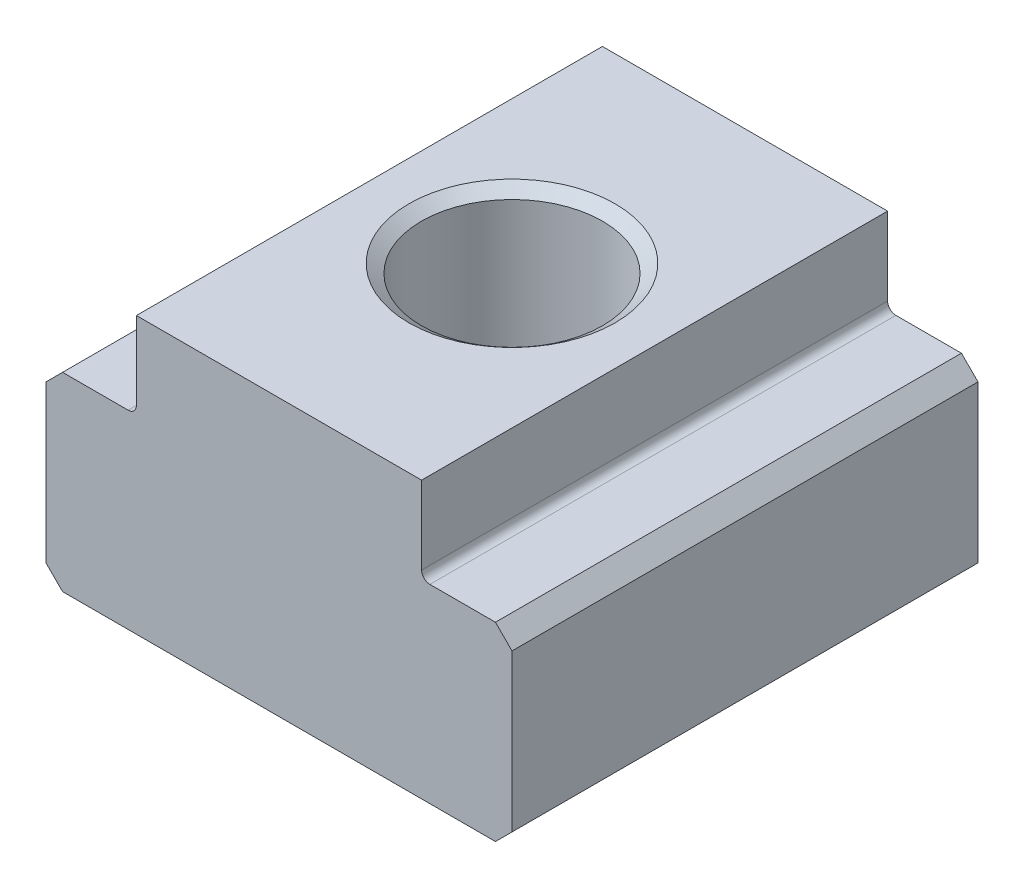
from build123d import *

# Parameters (mm, degrees)
BASENUT_DEPTH    = 42.8752
CHAMFERS_SIZE    = 1.524
TAPPEDHOLE_START = -25.4
SKETCH2_R        = 8.33374
TAPPEDHOLE_DEPTH = 25.4


with BuildPart() as part:
    # BaseNutSke → BaseNut (new body)
    with BuildSketch(Plane.XY):
        with BuildLine():
            Line((13.8811, 17.4752), (21.4376, 17.4752))
            Line((21.4376, 17.4752), (21.4376, 0))
            Line((21.4376, 0), (-21.4376, 0))
            Line((-21.4376, 0), (-21.4376, 17.4752))
            Line((-21.4376, 17.4752), (-13.8811, 17.4752))
            ThreePointArc((-13.8811, 17.4752), (-13.342284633, 17.698384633), (-13.1191, 18.2372))
            Line((-13.1191, 18.2372), (-13.1191, 25.4))
            Line((-13.1191, 25.4), (13.1191, 25.4))
            Line((13.1191, 25.4), (13.1191, 18.2372))
            ThreePointArc((13.1191, 18.2372), (13.342284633, 17.698384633), (13.8811, 17.4752))
        make_face()
    extrude(amount=-BASENUT_DEPTH)

    # Chamfers
    chamfers_edges = [part.edges().sort_by_distance(p)[0] for p in [
        (-21.4376, 17.4752, -21.4376),
        (21.4376, 17.4752, -21.4376),
        (21.4376, 0, -21.4376),
        (-21.4376, 0, -21.4376),
    ]]
    chamfer(chamfers_edges, length=CHAMFERS_SIZE)

    # Sketch2 → TappedHole (cut)
    with BuildSketch(Plane(origin=(0, 25.4, 0), x_dir=(-1, 0, 0), z_dir=(0, 1, 0)).offset(TAPPEDHOLE_START)):
        with Locations((0, -21.4376)):
            Circle(SKETCH2_R)
    extrude(amount=TAPPEDHOLE_DEPTH, mode=Mode.SUBTRACT)

    # EndChamferSketch → EndChamfer (revolve, cut)
    with BuildSketch(Plane(origin=(0, 0, 0), x_dir=(0, 0, -1), z_dir=(1, 0, 0)), mode=Mode.PRIVATE) as endchamfer_sk:
        Polygon((30.9626, -0.0254), (30.9626, 0.0254), (29.652214, 0.942942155), (29.652214, -0.0254), align=None)
        Polygon((30.9626, 25.4254), (29.652214, 24.507857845), (29.652214, 25.4254), align=None)
    revolve(endchamfer_sk.sketch.rotate(Axis((0, 44.45, -21.4376), (0, -1, 0)), 180), axis=Axis((0, 44.45, -21.4376), (0, -1, 0)), mode=Mode.SUBTRACT)


solid = part.part
